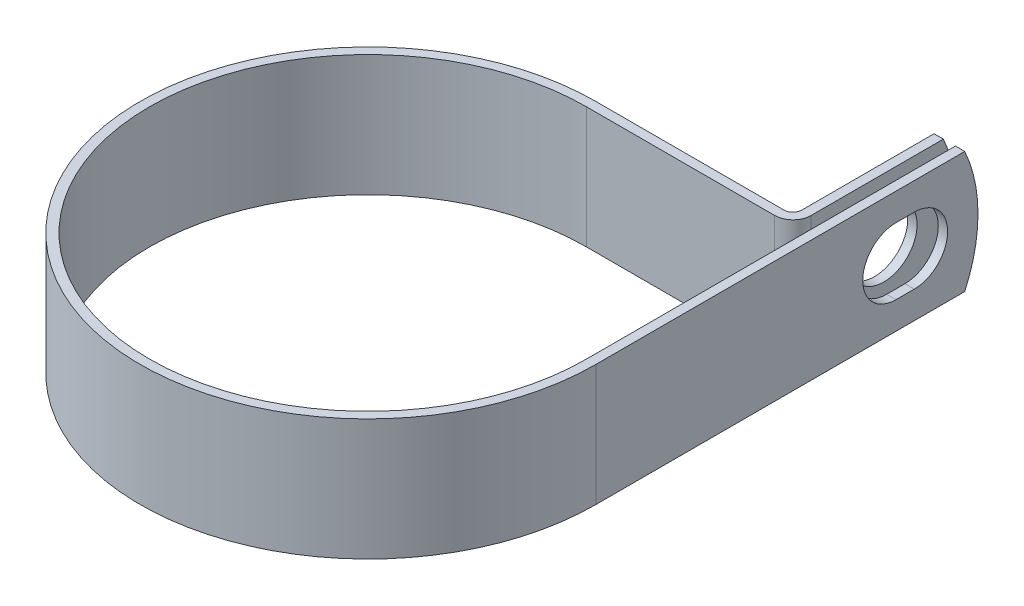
from build123d import *

# Parameters (mm, degrees)
EXTRUDE_THIN1_DEPTH = 7.9375
SKETCH2_R           = 4.3561
CUT_EXTRUDE1_DEPTH  = 1.2192
CUT_EXTRUDE2_REACH  = 80.182
CUT_EXTRUDE3_DEPTH  = 76.168656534


with BuildPart() as part:
    # Sketch1 → Extrude-Thin1 (new, symmetric)
    with BuildSketch(Plane(origin=(0, 0, 0), x_dir=(1, 0, 0), z_dir=(0, 1, 0))):
        with BuildLine():
            Line((28.575, 49.9872), (28.575, 28.575))
            Line((28.575, 28.575), (28.575, 0))
            ThreePointArc((28.575, 0), (-20.205576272, -20.205576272), (0, 28.575))
            Line((0, 28.575), (24.62276, 28.575))
            ThreePointArc((24.62276, 28.575), (26.303863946, 29.271336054), (27.0002, 30.95244))
            Line((27.0002, 30.95244), (27.0002, 49.9872))
            Line((27.0002, 49.9872), (25.781, 49.9872))
            Line((25.781, 49.9872), (25.781, 30.95244))
            ThreePointArc((25.781, 30.95244), (25.441759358, 30.133440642), (24.62276, 29.7942))
            Line((24.62276, 29.7942), (0, 29.7942))
            ThreePointArc((0, 29.7942), (-21.06768086, -21.06768086), (29.7942, 0))
            Line((29.7942, 0), (29.7942, 28.575))
            Line((29.7942, 28.575), (29.7942, 49.9872))
            Line((29.7942, 49.9872), (28.575, 49.9872))
        make_face()
    extrude(amount=EXTRUDE_THIN1_DEPTH, both=True)

    # Sketch2 → Cut-Extrude1 (cut)
    with BuildSketch(Plane.ZY.offset(-25.781)):
        with Locations((-40.4622, 0)):
            Circle(SKETCH2_R)
    extrude(amount=-CUT_EXTRUDE1_DEPTH, mode=Mode.SUBTRACT)

    # Sketch3 → Cut-Extrude2 (cut, up to next)
    with BuildSketch(Plane(origin=(29.7942, 0, 0), x_dir=(0, 0, -1), z_dir=(1, 0, 0)), mode=Mode.PRIVATE) as cut_extrude2_sk1:
        with BuildLine():
            Line((39.2684, 4.3561), (41.656, 4.3561))
            ThreePointArc((41.656, 4.3561), (46.0121, 0), (41.656, -4.3561))
            Line((41.656, -4.3561), (39.2684, -4.3561))
            ThreePointArc((39.2684, -4.3561), (34.9123, 0), (39.2684, 4.3561))
        make_face()
    cut_extrude2_tool1 = extrude(cut_extrude2_sk1.sketch, amount=-CUT_EXTRUDE2_REACH, mode=Mode.PRIVATE) & part.part
    add(cut_extrude2_tool1.solids().sort_by_distance((29.7942, 0, -40.4622))[0], mode=Mode.SUBTRACT)

    # Sketch4 → Cut-Extrude3 (cut, through all)
    with BuildSketch(Plane.ZY.offset(-25.781)):
        with BuildLine():
            Line((-48.254780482, 7.9375), (-49.9872, 7.9375))
            Line((-49.9872, 7.9375), (-49.9872, 0))
            ThreePointArc((-49.9872, 0), (-49.549056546, 4.062178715), (-48.254780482, 7.9375))
        make_face()
        with BuildLine():
            ThreePointArc((-48.254780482, -7.9375), (-49.549056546, -4.062178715), (-49.9872, 0))
            Line((-49.9872, 0), (-49.9872, -7.9375))
            Line((-49.9872, -7.9375), (-48.254780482, -7.9375))
        make_face()
    extrude(amount=-CUT_EXTRUDE3_DEPTH, mode=Mode.SUBTRACT)


solid = part.part
